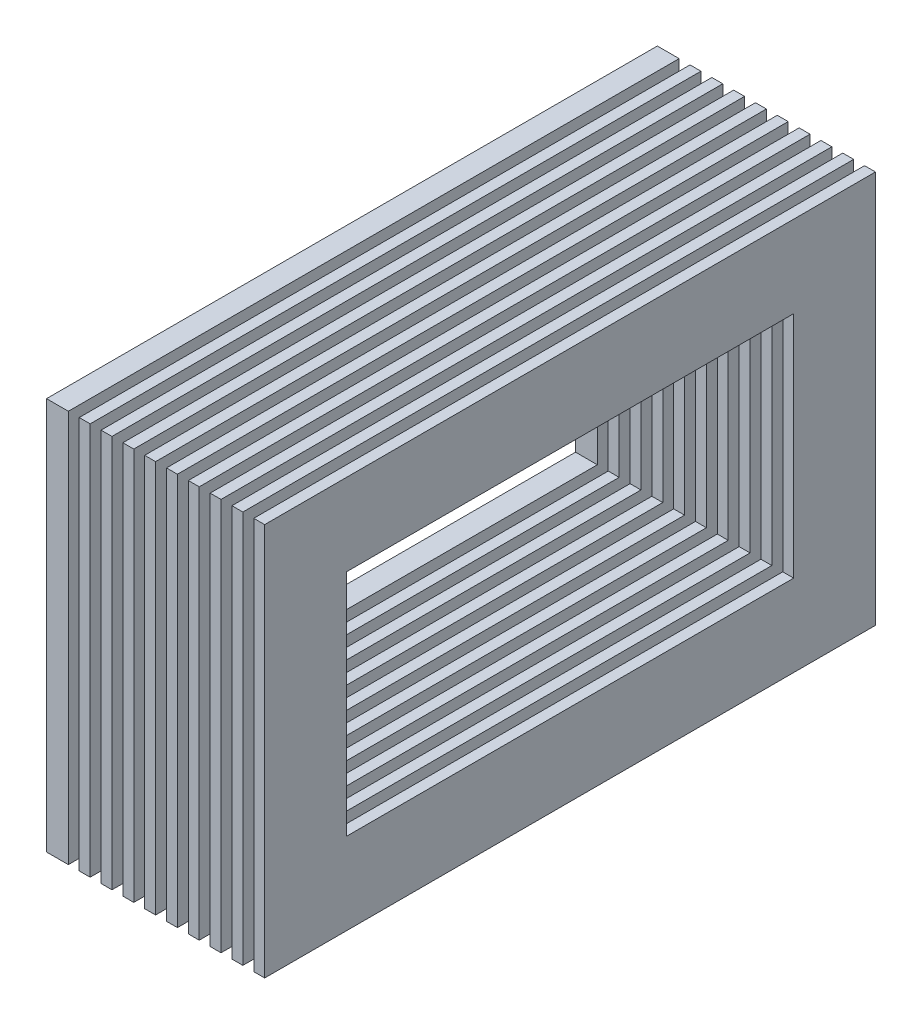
from build123d import *

# Parameters (mm, degrees)
SKETCH2_W           = 2
SKETCH2_H           = 5.6
BOSS_EXTRUDE1_DEPTH = 3.6
SKETCH3_W           = 4.1
SKETCH3_H           = 2.1
CUT_EXTRUDE1_DEPTH  = 5.979959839
SKETCH4_W           = 13.442502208
SKETCH4_H           = 8.363360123
CUT_EXTRUDE2_DEPTH  = 0.1
LPATTERN1_COUNT     = 108
LPATTERN1_PITCH     = 0.2


with BuildPart() as part:
    # Sketch2 → Boss-Extrude1 (new body)
    with BuildSketch(Plane(origin=(0, 0, 0), x_dir=(1, 0, 0), z_dir=(0, 1, 0))):
        Rectangle(SKETCH2_W, SKETCH2_H)
    extrude(amount=BOSS_EXTRUDE1_DEPTH)

    # Sketch3 → Cut-Extrude1 (cut, through all)
    with BuildSketch(Plane.ZY.offset(1)):
        with Locations((0, 1.8)):
            Rectangle(SKETCH3_W, SKETCH3_H)
    extrude(amount=-CUT_EXTRUDE1_DEPTH, mode=Mode.SUBTRACT)

    # Sketch4 → Cut-Extrude2 (cut)
    with BuildSketch(Plane.ZY.offset(0.8)):
        with Locations((0, 2.61664664)):
            Rectangle(SKETCH4_W, SKETCH4_H)
    cut_extrude2 = extrude(amount=-CUT_EXTRUDE2_DEPTH, mode=Mode.SUBTRACT)


with BuildPart() as cut_extrude2_piece_1:
    # of the separate pieces the step leaves, piece 1, a body of its own (cut_extrude2_pieces)
    add(part.part.solids().sort_by_distance((-0.7, 0, 2.8))[0])

    # LPattern1: Cut-Extrude2 ×108
    with Locations(*[(i * LPATTERN1_PITCH, 0, 0) for i in range(1, LPATTERN1_COUNT)]):
        add(cut_extrude2, mode=Mode.SUBTRACT)


with BuildPart() as cut_extrude2_piece_2:
    # of the separate pieces the step leaves, piece 2, a body of its own (cut_extrude2_pieces)
    add(part.part.solids().sort_by_distance((-1, 0, 2.8))[0])


solid = Compound([cut_extrude2_piece_1.part, cut_extrude2_piece_2.part])
